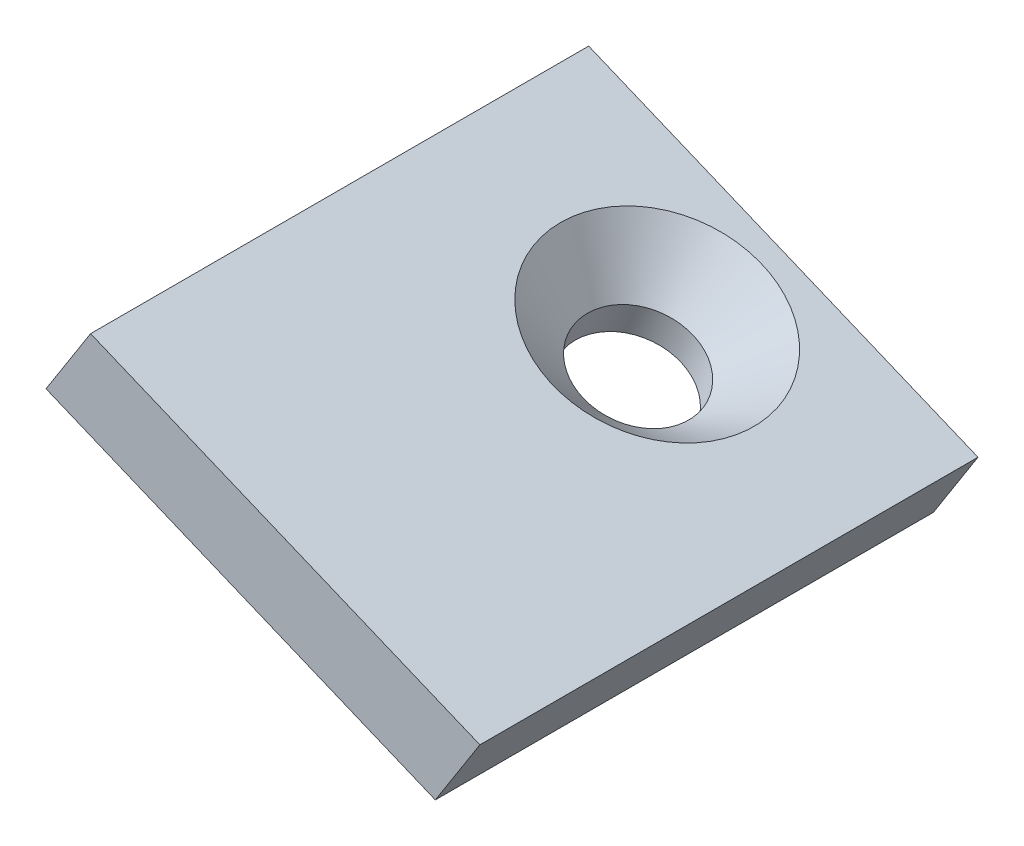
from build123d import *

# Parameters (mm, degrees)
BOSS_EXTRU_1_DEPTH                             = 30
FRAISAGE_POUR_VIS_T_TE_FRAIS_E_M61_D           = 6.6
FRAISAGE_POUR_VIS_T_TE_FRAIS_E_M61_CSINK_D     = 12.6
FRAISAGE_POUR_VIS_T_TE_FRAIS_E_M61_CSINK_ANGLE = 90


with BuildPart() as part:
    # Esquisse1 → Boss.-Extru.1 (new body)
    with BuildSketch(Plane.XY):
        Polygon((130.737521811, -61.770307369), (107.290794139, -52.047482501), (109.976178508, -47.829815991), (133.42290618, -57.552640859), align=None)
    extrude(amount=BOSS_EXTRU_1_DEPTH)

    # Fraisage pour vis _ t_te frais_e M61 (through all)
    with Locations(Plane(origin=(-0.787347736, -1.898700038, 0), x_dir=(0.9237280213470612, -0.3830490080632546, 0), z_dir=(0.3830490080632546, 0.9237280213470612, 0))):
        with Locations((132.60060023, -7.597839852)):
            CounterSinkHole(FRAISAGE_POUR_VIS_T_TE_FRAIS_E_M61_D / 2, FRAISAGE_POUR_VIS_T_TE_FRAIS_E_M61_CSINK_D / 2, counter_sink_angle=FRAISAGE_POUR_VIS_T_TE_FRAIS_E_M61_CSINK_ANGLE)


solid = part.part
